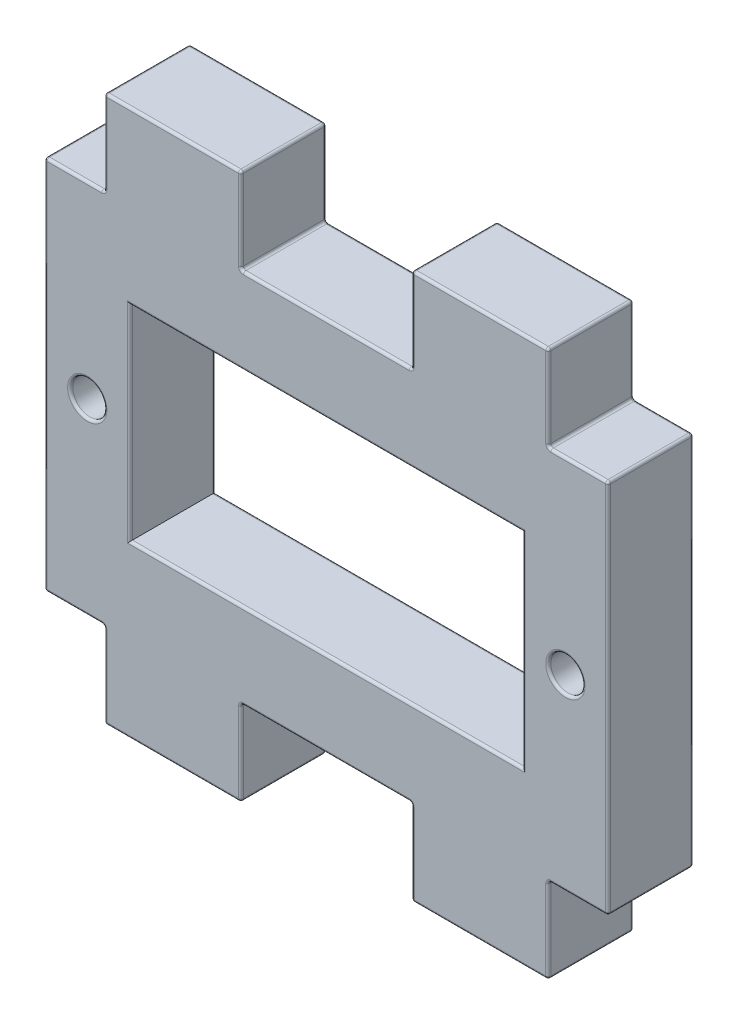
from build123d import *

# Parameters (mm, degrees)
SKETCH1_W           = 33
SKETCH1_H           = 22
SKETCH1_R           = 1
SKETCH1_W_2         = 23
SKETCH1_H_2         = 12
SKETCH1_W_3         = 8
SKETCH1_H_3         = 5
BOSS_EXTRUDE1_DEPTH = 2.5
FILLET1_R           = 0.15
FILLET2_R           = 0.15


with BuildPart() as part:
    # Sketch1 → Boss-Extrude1 (new, symmetric)
    # profile 1 of 5: a face of its own
    with BuildSketch(Plane.XY):
        Rectangle(SKETCH1_W, SKETCH1_H)
        with Locations((-14, 0)):
            Circle(SKETCH1_R, mode=Mode.SUBTRACT)
        with Locations((14, 0)):
            Circle(SKETCH1_R, mode=Mode.SUBTRACT)
        Rectangle(SKETCH1_W_2, SKETCH1_H_2, mode=Mode.SUBTRACT)
    # profile 2 of 5: a face of its own
    with BuildSketch(Plane.XY):
        with Locations((-9, 13.5)):
            Rectangle(SKETCH1_W_3, SKETCH1_H_3)
    # profile 3 of 5: a face of its own
    with BuildSketch(Plane.XY):
        with Locations((9, 13.5)):
            Rectangle(SKETCH1_W_3, SKETCH1_H_3)
    # profile 4 of 5: a face of its own
    with BuildSketch(Plane.XY):
        with Locations((-9, -13.5)):
            Rectangle(SKETCH1_W_3, SKETCH1_H_3)
    # profile 5 of 5: a face of its own
    with BuildSketch(Plane.XY):
        with Locations((9, -13.5)):
            Rectangle(SKETCH1_W_3, SKETCH1_H_3)
    extrude(amount=BOSS_EXTRUDE1_DEPTH, both=True)

    # Fillet1
    fillet1_edges = [part.edges().sort_by_distance(p)[0] for p in [
        (16.5, 0, 2.5),
        (14.75, 11, 2.5),
        (13, 13.5, 2.5),
        (9, 16, 2.5),
        (5, 13.5, 2.5),
        (13, -13.5, -2.5),
        (9, -16, -2.5),
        (5, -13.5, -2.5),
        (0, -11, -2.5),
        (-5, -13.5, -2.5),
        (-9, -16, -2.5),
        (0, 11, 2.5),
        (-13, -13.5, -2.5),
        (-14.75, -11, -2.5),
        (-16.5, 0, -2.5),
        (-14.75, 11, -2.5),
        (-13, 13.5, -2.5),
        (-9, 16, -2.5),
        (-5, 13.5, 2.5),
        (-5, 13.5, -2.5),
        (0, 11, -2.5),
        (5, 13.5, -2.5),
        (9, 16, -2.5),
        (13, 13.5, -2.5),
        (14.75, 11, -2.5),
        (16.5, 0, -2.5),
        (14.75, -11, -2.5),
        (-9, 16, 2.5),
        (-13, 13.5, 2.5),
        (13, -11, 0),
        (13, -16, 0),
        (-14.75, 11, 2.5),
        (5, -16, 0),
        (5, -11, 0),
        (-5, -11, 0),
        (-5, -16, 0),
        (-13, -16, 0),
        (-13, -11, 0),
        (-16.5, -11, 0),
        (-16.5, 11, 0),
        (-13, 11, 0),
        (-13, 16, 0),
        (-5, 16, 0),
        (-5, 11, 0),
        (5, 11, 0),
        (5, 16, 0),
        (13, 16, 0),
        (13, 11, 0),
        (16.5, 11, 0),
        (16.5, -11, 0),
        (-16.5, 0, 2.5),
        (-14.75, -11, 2.5),
        (-13, -13.5, 2.5),
        (-9, -16, 2.5),
        (-5, -13.5, 2.5),
        (0, -11, 2.5),
        (14.75, -11, 2.5),
        (5, -13.5, 2.5),
        (9, -16, 2.5),
        (13, -13.5, 2.5),
    ]]
    fillet(fillet1_edges, radius=FILLET1_R)

    # Fillet2
    fillet2_edges = [part.edges().sort_by_distance(p)[0] for p in [
        (13, 0, 2.5),
        (13, 0, -2.5),
        (-15, 0, -2.5),
        (11.5, 0, -2.5),
        (0, 6, -2.5),
        (-11.5, 0, -2.5),
        (0, -6, -2.5),
        (0, -6, 2.5),
        (-11.5, 0, 2.5),
        (0, 6, 2.5),
        (11.5, 0, 2.5),
        (-15, 0, 2.5),
    ]]
    fillet(fillet2_edges, radius=FILLET2_R)


solid = part.part
